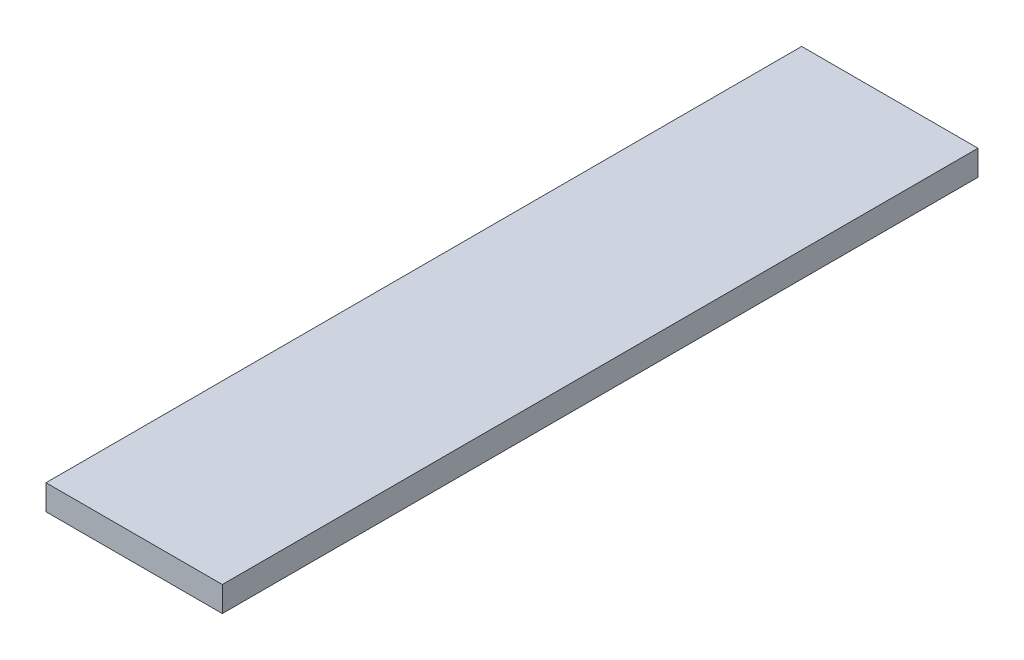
from build123d import *

# Parameters (mm, degrees)
SKETCH1_W           = 7
SKETCH1_H           = 30
BOSS_EXTRUDE1_DEPTH = 0.5


with BuildPart() as part:
    # Sketch1 → Boss-Extrude1 (new, symmetric)
    with BuildSketch(Plane(origin=(0, 0, 0), x_dir=(1, 0, 0), z_dir=(0, 1, 0))):
        Rectangle(SKETCH1_W, SKETCH1_H)
    extrude(amount=BOSS_EXTRUDE1_DEPTH, both=True)


solid = part.part
